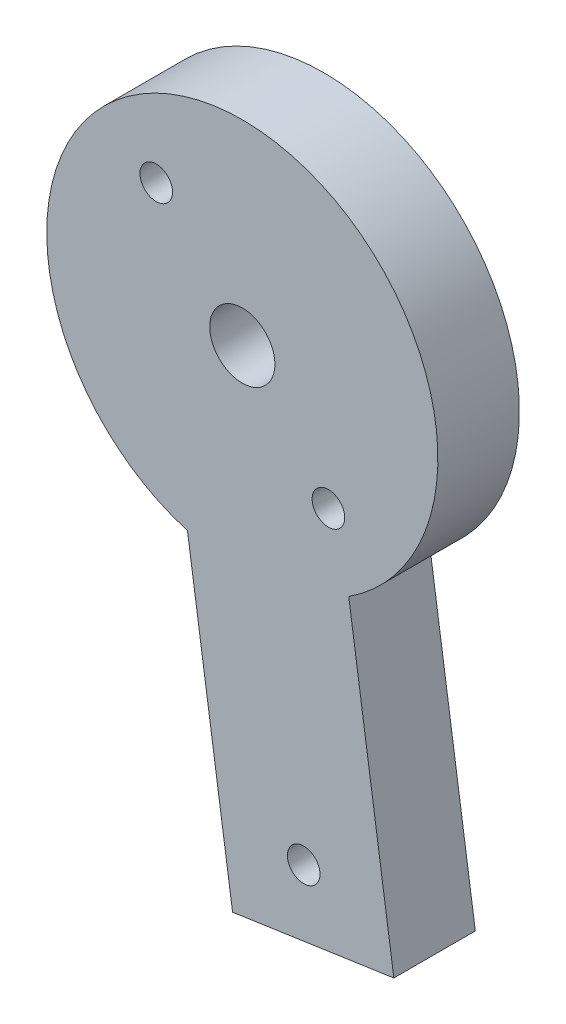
ISO-10303-21;
HEADER;
FILE_DESCRIPTION(('STEP AP214'),'2;1');
FILE_NAME('part.step','',(''),(''),'','','');
FILE_SCHEMA(('AUTOMOTIVE_DESIGN { 1 0 10303 214 1 1 1 1 }'));
ENDSEC;
DATA;
#1=APPLICATION_CONTEXT('core data for automotive mechanical design processes');
#2=APPLICATION_PROTOCOL_DEFINITION('international standard','automotive_design',2000,#1);
#3=PRODUCT_CONTEXT('',#1,'mechanical');
#4=PRODUCT('Part','Part','',(#3));
#5=PRODUCT_RELATED_PRODUCT_CATEGORY('part','',(#4));
#6=PRODUCT_DEFINITION_FORMATION('','',#4);
#7=PRODUCT_DEFINITION_CONTEXT('part definition',#1,'design');
#8=PRODUCT_DEFINITION('design','',#6,#7);
#9=PRODUCT_DEFINITION_SHAPE('','',#8);
#10=(LENGTH_UNIT() NAMED_UNIT(*) SI_UNIT(.MILLI.,.METRE.));
#11=(NAMED_UNIT(*) PLANE_ANGLE_UNIT() SI_UNIT($,.RADIAN.));
#12=(NAMED_UNIT(*) SI_UNIT($,.STERADIAN.) SOLID_ANGLE_UNIT());
#13=UNCERTAINTY_MEASURE_WITH_UNIT(LENGTH_MEASURE(1.E-05),#10,'distance_accuracy_value','');
#14=(GEOMETRIC_REPRESENTATION_CONTEXT(3) GLOBAL_UNCERTAINTY_ASSIGNED_CONTEXT((#13)) GLOBAL_UNIT_ASSIGNED_CONTEXT((#10,
#11,#12)) REPRESENTATION_CONTEXT('',''));
#15=CARTESIAN_POINT('',(0.,0.,0.));
#16=DIRECTION('',(0.,0.,1.));
#17=DIRECTION('',(1.,0.,0.));
#18=AXIS2_PLACEMENT_3D('',#15,#16,#17);
#19=CARTESIAN_POINT('',(-0.598155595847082,-30.4079300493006,5.));
#20=DIRECTION('',(-0.144967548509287,0.989436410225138,0.));
#21=DIRECTION('',(-0.989436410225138,-0.144967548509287,0.));
#22=AXIS2_PLACEMENT_3D('',#19,#20,#21);
#23=PLANE('',#22);
#24=DIRECTION('',(0.989436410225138,0.144967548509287,0.));
#25=VECTOR('',#24,1.);
#26=CARTESIAN_POINT('',(-0.598155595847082,-30.4079300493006,0.));
#27=LINE('',#26,#25);
#28=CARTESIAN_POINT('',(-0.598155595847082,-30.4079300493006,0.));
#29=VERTEX_POINT('',#28);
#30=CARTESIAN_POINT('',(9.2962085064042,-28.9582545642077,0.));
#31=VERTEX_POINT('',#30);
#32=EDGE_CURVE('E98',#29,#31,#27,.T.);
#33=ORIENTED_EDGE('',*,*,#32,.T.);
#34=DIRECTION('',(0.,0.,-1.));
#35=VECTOR('',#34,1.);
#36=CARTESIAN_POINT('',(9.2962085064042,-28.9582545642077,5.));
#37=LINE('',#36,#35);
#38=CARTESIAN_POINT('',(9.2962085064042,-28.9582545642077,5.));
#39=VERTEX_POINT('',#38);
#40=EDGE_CURVE('E11',#39,#31,#37,.T.);
#41=ORIENTED_EDGE('',*,*,#40,.F.);
#42=DIRECTION('',(0.989436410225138,0.144967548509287,0.));
#43=VECTOR('',#42,1.);
#44=CARTESIAN_POINT('',(-0.598155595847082,-30.4079300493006,5.));
#45=LINE('',#44,#43);
#46=CARTESIAN_POINT('',(-0.598155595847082,-30.4079300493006,5.));
#47=VERTEX_POINT('',#46);
#48=EDGE_CURVE('E86',#47,#39,#45,.T.);
#49=ORIENTED_EDGE('',*,*,#48,.F.);
#50=DIRECTION('',(0.,0.,-1.));
#51=VECTOR('',#50,1.);
#52=CARTESIAN_POINT('',(-0.598155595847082,-30.4079300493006,5.));
#53=LINE('',#52,#51);
#54=EDGE_CURVE('E94',#47,#29,#53,.T.);
#55=ORIENTED_EDGE('',*,*,#54,.T.);
#56=EDGE_LOOP('',(#33,#41,#49,#55));
#57=FACE_BOUND('',#56,.T.);
#58=ADVANCED_FACE('F35',(#57),#23,.F.);
#59=CARTESIAN_POINT('',(9.2962085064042,-28.9582545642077,5.));
#60=DIRECTION('',(-0.989436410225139,-0.144967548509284,0.));
#61=DIRECTION('',(0.144967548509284,-0.989436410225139,0.));
#62=AXIS2_PLACEMENT_3D('',#59,#60,#61);
#63=PLANE('',#62);
#64=DIRECTION('',(-0.144967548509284,0.989436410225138,0.));
#65=VECTOR('',#64,1.);
#66=CARTESIAN_POINT('',(9.2962085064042,-28.9582545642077,0.));
#67=LINE('',#66,#65);
#68=CARTESIAN_POINT('',(6.52859130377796,-10.0686392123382,0.));
#69=VERTEX_POINT('',#68);
#70=EDGE_CURVE('E90',#31,#69,#67,.T.);
#71=ORIENTED_EDGE('',*,*,#70,.T.);
#72=DIRECTION('',(0.,0.,-1.));
#73=VECTOR('',#72,1.);
#74=CARTESIAN_POINT('',(6.52859130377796,-10.0686392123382,5.));
#75=LINE('',#74,#73);
#76=CARTESIAN_POINT('',(6.52859130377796,-10.0686392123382,5.));
#77=VERTEX_POINT('',#76);
#78=EDGE_CURVE('E43',#77,#69,#75,.T.);
#79=ORIENTED_EDGE('',*,*,#78,.F.);
#80=DIRECTION('',(-0.144967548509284,0.989436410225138,0.));
#81=VECTOR('',#80,1.);
#82=CARTESIAN_POINT('',(9.2962085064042,-28.9582545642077,5.));
#83=LINE('',#82,#81);
#84=EDGE_CURVE('E81',#39,#77,#83,.T.);
#85=ORIENTED_EDGE('',*,*,#84,.F.);
#86=ORIENTED_EDGE('',*,*,#40,.T.);
#87=EDGE_LOOP('',(#71,#79,#85,#86));
#88=FACE_BOUND('',#87,.T.);
#89=ADVANCED_FACE('F89',(#88),#63,.F.);
#90=CARTESIAN_POINT('',(0.,0.,5.));
#91=DIRECTION('',(0.,0.,-1.));
#92=DIRECTION('',(-1.,0.,0.));
#93=AXIS2_PLACEMENT_3D('',#90,#91,#92);
#94=CYLINDRICAL_SURFACE('',#93,12.);
#95=CARTESIAN_POINT('',(0.,0.,0.));
#96=DIRECTION('',(0.,0.,1.));
#97=DIRECTION('',(1.,0.,0.));
#98=AXIS2_PLACEMENT_3D('',#95,#96,#97);
#99=CIRCLE('',#98,12.);
#100=CARTESIAN_POINT('',(-3.36577279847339,-11.5183146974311,0.));
#101=VERTEX_POINT('',#100);
#102=EDGE_CURVE('E68',#69,#101,#99,.T.);
#103=ORIENTED_EDGE('',*,*,#102,.T.);
#104=DIRECTION('',(0.,0.,-1.));
#105=VECTOR('',#104,1.);
#106=CARTESIAN_POINT('',(-3.36577279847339,-11.5183146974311,5.));
#107=LINE('',#106,#105);
#108=CARTESIAN_POINT('',(-3.36577279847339,-11.5183146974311,5.));
#109=VERTEX_POINT('',#108);
#110=EDGE_CURVE('E91',#109,#101,#107,.T.);
#111=ORIENTED_EDGE('',*,*,#110,.F.);
#112=CARTESIAN_POINT('',(0.,0.,5.));
#113=DIRECTION('',(0.,0.,1.));
#114=DIRECTION('',(1.,0.,0.));
#115=AXIS2_PLACEMENT_3D('',#112,#113,#114);
#116=CIRCLE('',#115,12.);
#117=EDGE_CURVE('E84',#77,#109,#116,.T.);
#118=ORIENTED_EDGE('',*,*,#117,.F.);
#119=ORIENTED_EDGE('',*,*,#78,.T.);
#120=EDGE_LOOP('',(#103,#111,#118,#119));
#121=FACE_BOUND('',#120,.T.);
#122=ADVANCED_FACE('F92',(#121),#94,.T.);
#123=CARTESIAN_POINT('',(-3.36577279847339,-11.5183146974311,5.));
#124=DIRECTION('',(0.989436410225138,0.144967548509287,0.));
#125=DIRECTION('',(-0.144967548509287,0.989436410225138,0.));
#126=AXIS2_PLACEMENT_3D('',#123,#124,#125);
#127=PLANE('',#126);
#128=DIRECTION('',(0.144967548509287,-0.989436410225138,0.));
#129=VECTOR('',#128,1.);
#130=CARTESIAN_POINT('',(-3.36577279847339,-11.5183146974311,0.));
#131=LINE('',#130,#129);
#132=EDGE_CURVE('E74',#101,#29,#131,.T.);
#133=ORIENTED_EDGE('',*,*,#132,.T.);
#134=ORIENTED_EDGE('',*,*,#54,.F.);
#135=DIRECTION('',(0.144967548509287,-0.989436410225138,0.));
#136=VECTOR('',#135,1.);
#137=CARTESIAN_POINT('',(-3.36577279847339,-11.5183146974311,5.));
#138=LINE('',#137,#136);
#139=EDGE_CURVE('E51',#109,#47,#138,.T.);
#140=ORIENTED_EDGE('',*,*,#139,.F.);
#141=ORIENTED_EDGE('',*,*,#110,.T.);
#142=EDGE_LOOP('',(#133,#134,#140,#141));
#143=FACE_BOUND('',#142,.T.);
#144=ADVANCED_FACE('F106',(#143),#127,.F.);
#145=CARTESIAN_POINT('',(0.,0.,5.));
#146=DIRECTION('',(0.,0.,1.));
#147=DIRECTION('',(1.,0.,0.));
#148=AXIS2_PLACEMENT_3D('',#145,#146,#147);
#149=PLANE('',#148);
#150=CARTESIAN_POINT('',(5.2819431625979,-6.00841713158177,5.));
#151=DIRECTION('',(0.,0.,1.));
#152=DIRECTION('',(1.,0.,0.));
#153=AXIS2_PLACEMENT_3D('',#150,#151,#152);
#154=CIRCLE('',#153,1.);
#155=CARTESIAN_POINT('',(6.2819431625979,-6.00841713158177,5.));
#156=VERTEX_POINT('',#155);
#157=EDGE_CURVE('E130',#156,#156,#154,.T.);
#158=ORIENTED_EDGE('',*,*,#157,.F.);
#159=EDGE_LOOP('',(#158));
#160=FACE_BOUND('',#159,.T.);
#161=CARTESIAN_POINT('',(-5.28194316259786,6.0084171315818,5.));
#162=DIRECTION('',(0.,0.,1.));
#163=DIRECTION('',(1.,0.,0.));
#164=AXIS2_PLACEMENT_3D('',#161,#162,#163);
#165=CIRCLE('',#164,1.);
#166=CARTESIAN_POINT('',(-4.28194316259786,6.0084171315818,5.));
#167=VERTEX_POINT('',#166);
#168=EDGE_CURVE('E124',#167,#167,#165,.T.);
#169=ORIENTED_EDGE('',*,*,#168,.F.);
#170=EDGE_LOOP('',(#169));
#171=FACE_BOUND('',#170,.T.);
#172=CARTESIAN_POINT('',(3.76692955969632,-25.7101489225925,5.));
#173=DIRECTION('',(0.,0.,1.));
#174=DIRECTION('',(1.,0.,0.));
#175=AXIS2_PLACEMENT_3D('',#172,#173,#174);
#176=CIRCLE('',#175,1.);
#177=CARTESIAN_POINT('',(4.76692955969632,-25.7101489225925,5.));
#178=VERTEX_POINT('',#177);
#179=EDGE_CURVE('E118',#178,#178,#176,.T.);
#180=ORIENTED_EDGE('',*,*,#179,.F.);
#181=EDGE_LOOP('',(#180));
#182=FACE_BOUND('',#181,.T.);
#183=CARTESIAN_POINT('',(0.,0.,5.));
#184=DIRECTION('',(0.,0.,1.));
#185=DIRECTION('',(1.,0.,0.));
#186=AXIS2_PLACEMENT_3D('',#183,#184,#185);
#187=CIRCLE('',#186,2.);
#188=CARTESIAN_POINT('',(2.,0.,5.));
#189=VERTEX_POINT('',#188);
#190=EDGE_CURVE('E112',#189,#189,#187,.T.);
#191=ORIENTED_EDGE('',*,*,#190,.F.);
#192=EDGE_LOOP('',(#191));
#193=FACE_BOUND('',#192,.T.);
#194=ORIENTED_EDGE('',*,*,#48,.T.);
#195=ORIENTED_EDGE('',*,*,#84,.T.);
#196=ORIENTED_EDGE('',*,*,#117,.T.);
#197=ORIENTED_EDGE('',*,*,#139,.T.);
#198=EDGE_LOOP('',(#194,#195,#196,#197));
#199=FACE_BOUND('',#198,.T.);
#200=ADVANCED_FACE('F82',(#160,#171,#182,#193,#199),#149,.T.);
#201=CARTESIAN_POINT('',(0.,0.,0.));
#202=DIRECTION('',(0.,0.,1.));
#203=DIRECTION('',(1.,0.,0.));
#204=AXIS2_PLACEMENT_3D('',#201,#202,#203);
#205=PLANE('',#204);
#206=CARTESIAN_POINT('',(5.2819431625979,-6.00841713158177,0.));
#207=DIRECTION('',(0.,0.,1.));
#208=DIRECTION('',(1.,0.,0.));
#209=AXIS2_PLACEMENT_3D('',#206,#207,#208);
#210=CIRCLE('',#209,1.);
#211=CARTESIAN_POINT('',(6.2819431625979,-6.00841713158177,0.));
#212=VERTEX_POINT('',#211);
#213=EDGE_CURVE('E127',#212,#212,#210,.T.);
#214=ORIENTED_EDGE('',*,*,#213,.T.);
#215=EDGE_LOOP('',(#214));
#216=FACE_BOUND('',#215,.T.);
#217=CARTESIAN_POINT('',(-5.28194316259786,6.0084171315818,0.));
#218=DIRECTION('',(0.,0.,1.));
#219=DIRECTION('',(1.,0.,0.));
#220=AXIS2_PLACEMENT_3D('',#217,#218,#219);
#221=CIRCLE('',#220,1.);
#222=CARTESIAN_POINT('',(-4.28194316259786,6.0084171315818,0.));
#223=VERTEX_POINT('',#222);
#224=EDGE_CURVE('E121',#223,#223,#221,.T.);
#225=ORIENTED_EDGE('',*,*,#224,.T.);
#226=EDGE_LOOP('',(#225));
#227=FACE_BOUND('',#226,.T.);
#228=CARTESIAN_POINT('',(3.76692955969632,-25.7101489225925,0.));
#229=DIRECTION('',(0.,0.,1.));
#230=DIRECTION('',(1.,0.,0.));
#231=AXIS2_PLACEMENT_3D('',#228,#229,#230);
#232=CIRCLE('',#231,1.);
#233=CARTESIAN_POINT('',(4.76692955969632,-25.7101489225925,0.));
#234=VERTEX_POINT('',#233);
#235=EDGE_CURVE('E115',#234,#234,#232,.T.);
#236=ORIENTED_EDGE('',*,*,#235,.T.);
#237=EDGE_LOOP('',(#236));
#238=FACE_BOUND('',#237,.T.);
#239=CARTESIAN_POINT('',(0.,0.,0.));
#240=DIRECTION('',(0.,0.,1.));
#241=DIRECTION('',(1.,0.,0.));
#242=AXIS2_PLACEMENT_3D('',#239,#240,#241);
#243=CIRCLE('',#242,2.);
#244=CARTESIAN_POINT('',(2.,0.,0.));
#245=VERTEX_POINT('',#244);
#246=EDGE_CURVE('E101',#245,#245,#243,.T.);
#247=ORIENTED_EDGE('',*,*,#246,.T.);
#248=EDGE_LOOP('',(#247));
#249=FACE_BOUND('',#248,.T.);
#250=ORIENTED_EDGE('',*,*,#32,.F.);
#251=ORIENTED_EDGE('',*,*,#132,.F.);
#252=ORIENTED_EDGE('',*,*,#102,.F.);
#253=ORIENTED_EDGE('',*,*,#70,.F.);
#254=EDGE_LOOP('',(#250,#251,#252,#253));
#255=FACE_BOUND('',#254,.T.);
#256=ADVANCED_FACE('F109',(#216,#227,#238,#249,#255),#205,.F.);
#257=CARTESIAN_POINT('',(0.,0.,0.));
#258=DIRECTION('',(0.,0.,1.));
#259=DIRECTION('',(1.,0.,0.));
#260=AXIS2_PLACEMENT_3D('',#257,#258,#259);
#261=CYLINDRICAL_SURFACE('',#260,2.);
#262=ORIENTED_EDGE('',*,*,#246,.F.);
#263=EDGE_LOOP('',(#262));
#264=FACE_BOUND('',#263,.T.);
#265=ORIENTED_EDGE('',*,*,#190,.T.);
#266=EDGE_LOOP('',(#265));
#267=FACE_BOUND('',#266,.T.);
#268=ADVANCED_FACE('F154',(#264,#267),#261,.F.);
#269=CARTESIAN_POINT('',(3.76692955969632,-25.7101489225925,0.));
#270=DIRECTION('',(0.,0.,1.));
#271=DIRECTION('',(1.,0.,0.));
#272=AXIS2_PLACEMENT_3D('',#269,#270,#271);
#273=CYLINDRICAL_SURFACE('',#272,1.);
#274=ORIENTED_EDGE('',*,*,#235,.F.);
#275=EDGE_LOOP('',(#274));
#276=FACE_BOUND('',#275,.T.);
#277=ORIENTED_EDGE('',*,*,#179,.T.);
#278=EDGE_LOOP('',(#277));
#279=FACE_BOUND('',#278,.T.);
#280=ADVANCED_FACE('F156',(#276,#279),#273,.F.);
#281=CARTESIAN_POINT('',(-5.28194316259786,6.0084171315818,0.));
#282=DIRECTION('',(0.,0.,1.));
#283=DIRECTION('',(1.,0.,0.));
#284=AXIS2_PLACEMENT_3D('',#281,#282,#283);
#285=CYLINDRICAL_SURFACE('',#284,1.);
#286=ORIENTED_EDGE('',*,*,#224,.F.);
#287=EDGE_LOOP('',(#286));
#288=FACE_BOUND('',#287,.T.);
#289=ORIENTED_EDGE('',*,*,#168,.T.);
#290=EDGE_LOOP('',(#289));
#291=FACE_BOUND('',#290,.T.);
#292=ADVANCED_FACE('F141',(#288,#291),#285,.F.);
#293=CARTESIAN_POINT('',(5.2819431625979,-6.00841713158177,0.));
#294=DIRECTION('',(0.,0.,1.));
#295=DIRECTION('',(1.,0.,0.));
#296=AXIS2_PLACEMENT_3D('',#293,#294,#295);
#297=CYLINDRICAL_SURFACE('',#296,1.);
#298=ORIENTED_EDGE('',*,*,#213,.F.);
#299=EDGE_LOOP('',(#298));
#300=FACE_BOUND('',#299,.T.);
#301=ORIENTED_EDGE('',*,*,#157,.T.);
#302=EDGE_LOOP('',(#301));
#303=FACE_BOUND('',#302,.T.);
#304=ADVANCED_FACE('F138',(#300,#303),#297,.F.);
#305=CLOSED_SHELL('',(#58,#89,#122,#144,#200,#256,#268,#280,#292,#304));
#306=MANIFOLD_SOLID_BREP('B2',#305);
#307=ADVANCED_BREP_SHAPE_REPRESENTATION('',(#18,#306),#14);
#308=SHAPE_DEFINITION_REPRESENTATION(#9,#307);
ENDSEC;
END-ISO-10303-21;
